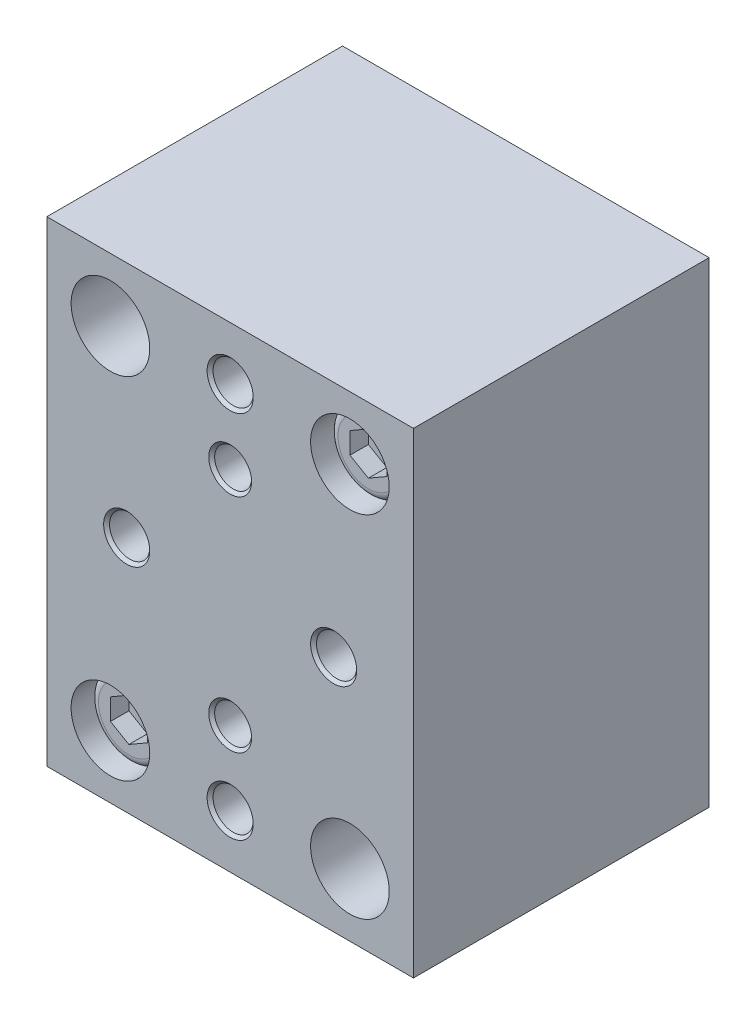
ISO-10303-21;
HEADER;
FILE_DESCRIPTION(('STEP AP214'),'2;1');
FILE_NAME('part.step','',(''),(''),'','','');
FILE_SCHEMA(('AUTOMOTIVE_DESIGN { 1 0 10303 214 1 1 1 1 }'));
ENDSEC;
DATA;
#1=APPLICATION_CONTEXT('core data for automotive mechanical design processes');
#2=APPLICATION_PROTOCOL_DEFINITION('international standard','automotive_design',2000,#1);
#3=PRODUCT_CONTEXT('',#1,'mechanical');
#4=PRODUCT('Part','Part','',(#3));
#5=PRODUCT_RELATED_PRODUCT_CATEGORY('part','',(#4));
#6=PRODUCT_DEFINITION_FORMATION('','',#4);
#7=PRODUCT_DEFINITION_CONTEXT('part definition',#1,'design');
#8=PRODUCT_DEFINITION('design','',#6,#7);
#9=PRODUCT_DEFINITION_SHAPE('','',#8);
#10=(LENGTH_UNIT() NAMED_UNIT(*) SI_UNIT(.MILLI.,.METRE.));
#11=(NAMED_UNIT(*) PLANE_ANGLE_UNIT() SI_UNIT($,.RADIAN.));
#12=(NAMED_UNIT(*) SI_UNIT($,.STERADIAN.) SOLID_ANGLE_UNIT());
#13=UNCERTAINTY_MEASURE_WITH_UNIT(LENGTH_MEASURE(1.E-05),#10,'distance_accuracy_value','');
#14=(GEOMETRIC_REPRESENTATION_CONTEXT(3) GLOBAL_UNCERTAINTY_ASSIGNED_CONTEXT((#13)) GLOBAL_UNIT_ASSIGNED_CONTEXT((#10,
#11,#12)) REPRESENTATION_CONTEXT('',''));
#15=CARTESIAN_POINT('',(0.,0.,0.));
#16=DIRECTION('',(0.,0.,1.));
#17=DIRECTION('',(1.,0.,0.));
#18=AXIS2_PLACEMENT_3D('',#15,#16,#17);
#19=CARTESIAN_POINT('',(-15.748,-20.447,23.8125));
#20=DIRECTION('',(0.,0.,1.));
#21=DIRECTION('',(1.,0.,0.));
#22=AXIS2_PLACEMENT_3D('',#19,#20,#21);
#23=PLANE('',#22);
#24=DIRECTION('',(-0.866025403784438,0.500000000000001,0.));
#25=VECTOR('',#24,1.);
#26=CARTESIAN_POINT('',(-8.6995,-14.1329564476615,23.8125));
#27=LINE('',#26,#25);
#28=CARTESIAN_POINT('',(-8.6995,-14.1329564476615,23.8125));
#29=VERTEX_POINT('',#28);
#30=CARTESIAN_POINT('',(-10.287,-13.2164128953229,23.8125));
#31=VERTEX_POINT('',#30);
#32=EDGE_CURVE('E61',#29,#31,#27,.T.);
#33=ORIENTED_EDGE('',*,*,#32,.F.);
#34=DIRECTION('',(0.,1.,0.));
#35=VECTOR('',#34,1.);
#36=CARTESIAN_POINT('',(-8.6995,-15.9660435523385,23.8125));
#37=LINE('',#36,#35);
#38=CARTESIAN_POINT('',(-8.6995,-15.9660435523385,23.8125));
#39=VERTEX_POINT('',#38);
#40=EDGE_CURVE('E144',#39,#29,#37,.T.);
#41=ORIENTED_EDGE('',*,*,#40,.F.);
#42=DIRECTION('',(0.86602540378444,0.499999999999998,0.));
#43=VECTOR('',#42,1.);
#44=CARTESIAN_POINT('',(-10.287,-16.8825871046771,23.8125));
#45=LINE('',#44,#43);
#46=CARTESIAN_POINT('',(-10.287,-16.8825871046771,23.8125));
#47=VERTEX_POINT('',#46);
#48=EDGE_CURVE('E142',#47,#39,#45,.T.);
#49=ORIENTED_EDGE('',*,*,#48,.F.);
#50=DIRECTION('',(0.86602540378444,-0.499999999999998,0.));
#51=VECTOR('',#50,1.);
#52=CARTESIAN_POINT('',(-11.8745,-15.9660435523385,23.8125));
#53=LINE('',#52,#51);
#54=CARTESIAN_POINT('',(-11.8745,-15.9660435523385,23.8125));
#55=VERTEX_POINT('',#54);
#56=EDGE_CURVE('E109',#55,#47,#53,.T.);
#57=ORIENTED_EDGE('',*,*,#56,.F.);
#58=DIRECTION('',(0.,-1.,0.));
#59=VECTOR('',#58,1.);
#60=CARTESIAN_POINT('',(-11.8745,-14.1329564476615,23.8125));
#61=LINE('',#60,#59);
#62=CARTESIAN_POINT('',(-11.8745,-14.1329564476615,23.8125));
#63=VERTEX_POINT('',#62);
#64=EDGE_CURVE('E138',#63,#55,#61,.T.);
#65=ORIENTED_EDGE('',*,*,#64,.F.);
#66=DIRECTION('',(-0.866025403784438,-0.500000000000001,0.));
#67=VECTOR('',#66,1.);
#68=CARTESIAN_POINT('',(-10.287,-13.2164128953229,23.8125));
#69=LINE('',#68,#67);
#70=EDGE_CURVE('E135',#31,#63,#69,.T.);
#71=ORIENTED_EDGE('',*,*,#70,.F.);
#72=EDGE_LOOP('',(#33,#41,#49,#57,#65,#71));
#73=FACE_BOUND('',#72,.T.);
#74=CARTESIAN_POINT('',(-10.287,-15.0495,23.8125));
#75=DIRECTION('',(0.,0.,1.));
#76=DIRECTION('',(1.,0.,0.));
#77=AXIS2_PLACEMENT_3D('',#74,#75,#76);
#78=CIRCLE('',#77,2.6162);
#79=CARTESIAN_POINT('',(-7.6708,-15.0495,23.8125));
#80=VERTEX_POINT('',#79);
#81=EDGE_CURVE('E12',#80,#80,#78,.T.);
#82=ORIENTED_EDGE('',*,*,#81,.T.);
#83=EDGE_LOOP('',(#82));
#84=FACE_BOUND('',#83,.T.);
#85=ADVANCED_FACE('F46',(#73,#84),#23,.T.);
#86=CARTESIAN_POINT('',(-10.287,-15.0495,0.));
#87=DIRECTION('',(0.,0.,-1.));
#88=DIRECTION('',(-1.,0.,0.));
#89=AXIS2_PLACEMENT_3D('',#86,#87,#88);
#90=PLANE('',#89);
#91=CARTESIAN_POINT('',(-10.287,-15.0495,0.));
#92=DIRECTION('',(0.,0.,-1.));
#93=DIRECTION('',(-1.,0.,0.));
#94=AXIS2_PLACEMENT_3D('',#91,#92,#93);
#95=CIRCLE('',#94,3.3782);
#96=CARTESIAN_POINT('',(-13.6652,-15.0495,0.));
#97=VERTEX_POINT('',#96);
#98=EDGE_CURVE('E148',#97,#97,#95,.T.);
#99=ORIENTED_EDGE('',*,*,#98,.T.);
#100=EDGE_LOOP('',(#99));
#101=FACE_BOUND('',#100,.T.);
#102=ADVANCED_FACE('F170',(#101),#90,.T.);
#103=CARTESIAN_POINT('',(-10.287,-15.0495,34.9549925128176));
#104=DIRECTION('',(0.,0.,-1.));
#105=DIRECTION('',(-1.,0.,0.));
#106=AXIS2_PLACEMENT_3D('',#103,#104,#105);
#107=CYLINDRICAL_SURFACE('',#106,3.3782);
#108=CARTESIAN_POINT('',(-10.287,-15.0495,23.0505));
#109=DIRECTION('',(0.,0.,1.));
#110=DIRECTION('',(1.,0.,0.));
#111=AXIS2_PLACEMENT_3D('',#108,#109,#110);
#112=CIRCLE('',#111,3.3782);
#113=CARTESIAN_POINT('',(-6.9088,-15.0495,23.0505));
#114=VERTEX_POINT('',#113);
#115=EDGE_CURVE('E54',#114,#114,#112,.F.);
#116=ORIENTED_EDGE('',*,*,#115,.T.);
#117=EDGE_LOOP('',(#116));
#118=FACE_BOUND('',#117,.T.);
#119=ORIENTED_EDGE('',*,*,#98,.F.);
#120=EDGE_LOOP('',(#119));
#121=FACE_BOUND('',#120,.T.);
#122=ADVANCED_FACE('F158',(#118,#121),#107,.T.);
#123=CARTESIAN_POINT('',(-10.287,-15.0495,23.0505));
#124=DIRECTION('',(0.,0.,1.));
#125=DIRECTION('',(1.,0.,0.));
#126=AXIS2_PLACEMENT_3D('',#123,#124,#125);
#127=TOROIDAL_SURFACE('',#126,2.6162,0.762);
#128=ORIENTED_EDGE('',*,*,#81,.F.);
#129=EDGE_LOOP('',(#128));
#130=FACE_BOUND('',#129,.T.);
#131=ORIENTED_EDGE('',*,*,#115,.F.);
#132=EDGE_LOOP('',(#131));
#133=FACE_BOUND('',#132,.T.);
#134=ADVANCED_FACE('F48',(#130,#133),#127,.T.);
#135=CARTESIAN_POINT('',(-8.6995,-14.1329564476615,22.225));
#136=DIRECTION('',(0.500000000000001,0.866025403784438,0.));
#137=DIRECTION('',(-0.866025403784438,0.500000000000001,0.));
#138=AXIS2_PLACEMENT_3D('',#135,#136,#137);
#139=PLANE('',#138);
#140=ORIENTED_EDGE('',*,*,#32,.T.);
#141=DIRECTION('',(0.,0.,1.));
#142=VECTOR('',#141,1.);
#143=CARTESIAN_POINT('',(-10.287,-13.2164128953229,22.225));
#144=LINE('',#143,#142);
#145=CARTESIAN_POINT('',(-10.287,-13.2164128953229,22.225));
#146=VERTEX_POINT('',#145);
#147=EDGE_CURVE('E91',#146,#31,#144,.T.);
#148=ORIENTED_EDGE('',*,*,#147,.F.);
#149=DIRECTION('',(-0.866025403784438,0.500000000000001,0.));
#150=VECTOR('',#149,1.);
#151=CARTESIAN_POINT('',(-8.6995,-14.1329564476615,22.225));
#152=LINE('',#151,#150);
#153=CARTESIAN_POINT('',(-8.6995,-14.1329564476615,22.225));
#154=VERTEX_POINT('',#153);
#155=EDGE_CURVE('E146',#154,#146,#152,.T.);
#156=ORIENTED_EDGE('',*,*,#155,.F.);
#157=DIRECTION('',(0.,0.,1.));
#158=VECTOR('',#157,1.);
#159=CARTESIAN_POINT('',(-8.6995,-14.1329564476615,22.225));
#160=LINE('',#159,#158);
#161=EDGE_CURVE('E69',#154,#29,#160,.T.);
#162=ORIENTED_EDGE('',*,*,#161,.T.);
#163=EDGE_LOOP('',(#140,#148,#156,#162));
#164=FACE_BOUND('',#163,.T.);
#165=ADVANCED_FACE('F162',(#164),#139,.F.);
#166=CARTESIAN_POINT('',(-8.6995,-15.9660435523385,22.225));
#167=DIRECTION('',(1.,0.,0.));
#168=DIRECTION('',(0.,0.,-1.));
#169=AXIS2_PLACEMENT_3D('',#166,#167,#168);
#170=PLANE('',#169);
#171=ORIENTED_EDGE('',*,*,#40,.T.);
#172=ORIENTED_EDGE('',*,*,#161,.F.);
#173=DIRECTION('',(0.,1.,0.));
#174=VECTOR('',#173,1.);
#175=CARTESIAN_POINT('',(-8.6995,-15.9660435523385,22.225));
#176=LINE('',#175,#174);
#177=CARTESIAN_POINT('',(-8.6995,-15.9660435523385,22.225));
#178=VERTEX_POINT('',#177);
#179=EDGE_CURVE('E121',#178,#154,#176,.T.);
#180=ORIENTED_EDGE('',*,*,#179,.F.);
#181=DIRECTION('',(0.,0.,1.));
#182=VECTOR('',#181,1.);
#183=CARTESIAN_POINT('',(-8.6995,-15.9660435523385,22.225));
#184=LINE('',#183,#182);
#185=EDGE_CURVE('E113',#178,#39,#184,.T.);
#186=ORIENTED_EDGE('',*,*,#185,.T.);
#187=EDGE_LOOP('',(#171,#172,#180,#186));
#188=FACE_BOUND('',#187,.T.);
#189=ADVANCED_FACE('F168',(#188),#170,.F.);
#190=CARTESIAN_POINT('',(-10.287,-16.8825871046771,22.225));
#191=DIRECTION('',(0.499999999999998,-0.86602540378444,0.));
#192=DIRECTION('',(0.86602540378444,0.499999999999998,0.));
#193=AXIS2_PLACEMENT_3D('',#190,#191,#192);
#194=PLANE('',#193);
#195=ORIENTED_EDGE('',*,*,#48,.T.);
#196=ORIENTED_EDGE('',*,*,#185,.F.);
#197=DIRECTION('',(0.86602540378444,0.499999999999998,0.));
#198=VECTOR('',#197,1.);
#199=CARTESIAN_POINT('',(-10.287,-16.8825871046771,22.225));
#200=LINE('',#199,#198);
#201=CARTESIAN_POINT('',(-10.287,-16.8825871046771,22.225));
#202=VERTEX_POINT('',#201);
#203=EDGE_CURVE('E117',#202,#178,#200,.T.);
#204=ORIENTED_EDGE('',*,*,#203,.F.);
#205=DIRECTION('',(0.,0.,1.));
#206=VECTOR('',#205,1.);
#207=CARTESIAN_POINT('',(-10.287,-16.8825871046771,22.225));
#208=LINE('',#207,#206);
#209=EDGE_CURVE('E102',#202,#47,#208,.T.);
#210=ORIENTED_EDGE('',*,*,#209,.T.);
#211=EDGE_LOOP('',(#195,#196,#204,#210));
#212=FACE_BOUND('',#211,.T.);
#213=ADVANCED_FACE('F118',(#212),#194,.F.);
#214=CARTESIAN_POINT('',(-11.8745,-15.9660435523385,22.225));
#215=DIRECTION('',(-0.499999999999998,-0.86602540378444,0.));
#216=DIRECTION('',(0.86602540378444,-0.499999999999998,0.));
#217=AXIS2_PLACEMENT_3D('',#214,#215,#216);
#218=PLANE('',#217);
#219=ORIENTED_EDGE('',*,*,#56,.T.);
#220=ORIENTED_EDGE('',*,*,#209,.F.);
#221=DIRECTION('',(0.86602540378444,-0.499999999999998,0.));
#222=VECTOR('',#221,1.);
#223=CARTESIAN_POINT('',(-11.8745,-15.9660435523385,22.225));
#224=LINE('',#223,#222);
#225=CARTESIAN_POINT('',(-11.8745,-15.9660435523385,22.225));
#226=VERTEX_POINT('',#225);
#227=EDGE_CURVE('E106',#226,#202,#224,.T.);
#228=ORIENTED_EDGE('',*,*,#227,.F.);
#229=DIRECTION('',(0.,0.,1.));
#230=VECTOR('',#229,1.);
#231=CARTESIAN_POINT('',(-11.8745,-15.9660435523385,22.225));
#232=LINE('',#231,#230);
#233=EDGE_CURVE('E114',#226,#55,#232,.T.);
#234=ORIENTED_EDGE('',*,*,#233,.T.);
#235=EDGE_LOOP('',(#219,#220,#228,#234));
#236=FACE_BOUND('',#235,.T.);
#237=ADVANCED_FACE('F104',(#236),#218,.F.);
#238=CARTESIAN_POINT('',(-11.8745,-14.1329564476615,22.225));
#239=DIRECTION('',(-1.,0.,0.));
#240=DIRECTION('',(0.,-1.,0.));
#241=AXIS2_PLACEMENT_3D('',#238,#239,#240);
#242=PLANE('',#241);
#243=ORIENTED_EDGE('',*,*,#64,.T.);
#244=ORIENTED_EDGE('',*,*,#233,.F.);
#245=DIRECTION('',(0.,-1.,0.));
#246=VECTOR('',#245,1.);
#247=CARTESIAN_POINT('',(-11.8745,-14.1329564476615,22.225));
#248=LINE('',#247,#246);
#249=CARTESIAN_POINT('',(-11.8745,-14.1329564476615,22.225));
#250=VERTEX_POINT('',#249);
#251=EDGE_CURVE('E127',#250,#226,#248,.T.);
#252=ORIENTED_EDGE('',*,*,#251,.F.);
#253=DIRECTION('',(0.,0.,1.));
#254=VECTOR('',#253,1.);
#255=CARTESIAN_POINT('',(-11.8745,-14.1329564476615,22.225));
#256=LINE('',#255,#254);
#257=EDGE_CURVE('E151',#250,#63,#256,.T.);
#258=ORIENTED_EDGE('',*,*,#257,.T.);
#259=EDGE_LOOP('',(#243,#244,#252,#258));
#260=FACE_BOUND('',#259,.T.);
#261=ADVANCED_FACE('F185',(#260),#242,.F.);
#262=CARTESIAN_POINT('',(-10.287,-13.2164128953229,22.225));
#263=DIRECTION('',(-0.500000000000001,0.866025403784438,0.));
#264=DIRECTION('',(-0.866025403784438,-0.500000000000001,0.));
#265=AXIS2_PLACEMENT_3D('',#262,#263,#264);
#266=PLANE('',#265);
#267=ORIENTED_EDGE('',*,*,#70,.T.);
#268=ORIENTED_EDGE('',*,*,#257,.F.);
#269=DIRECTION('',(-0.866025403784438,-0.500000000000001,0.));
#270=VECTOR('',#269,1.);
#271=CARTESIAN_POINT('',(-10.287,-13.2164128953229,22.225));
#272=LINE('',#271,#270);
#273=EDGE_CURVE('E129',#146,#250,#272,.T.);
#274=ORIENTED_EDGE('',*,*,#273,.F.);
#275=ORIENTED_EDGE('',*,*,#147,.T.);
#276=EDGE_LOOP('',(#267,#268,#274,#275));
#277=FACE_BOUND('',#276,.T.);
#278=ADVANCED_FACE('F182',(#277),#266,.F.);
#279=CARTESIAN_POINT('',(0.,0.,22.225));
#280=DIRECTION('',(0.,0.,1.));
#281=DIRECTION('',(1.,0.,0.));
#282=AXIS2_PLACEMENT_3D('',#279,#280,#281);
#283=PLANE('',#282);
#284=ORIENTED_EDGE('',*,*,#155,.T.);
#285=ORIENTED_EDGE('',*,*,#273,.T.);
#286=ORIENTED_EDGE('',*,*,#251,.T.);
#287=ORIENTED_EDGE('',*,*,#227,.T.);
#288=ORIENTED_EDGE('',*,*,#203,.T.);
#289=ORIENTED_EDGE('',*,*,#179,.T.);
#290=EDGE_LOOP('',(#284,#285,#286,#287,#288,#289));
#291=FACE_BOUND('',#290,.T.);
#292=ADVANCED_FACE('F124',(#291),#283,.T.);
#293=CLOSED_SHELL('',(#85,#102,#122,#134,#165,#189,#213,#237,#261,#278,#292));
#294=MANIFOLD_SOLID_BREP('B2',#293);
#295=CARTESIAN_POINT('',(-15.748,-20.447,23.8125));
#296=DIRECTION('',(0.,0.,1.));
#297=DIRECTION('',(1.,0.,0.));
#298=AXIS2_PLACEMENT_3D('',#295,#296,#297);
#299=PLANE('',#298);
#300=DIRECTION('',(-0.866025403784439,0.5,0.));
#301=VECTOR('',#300,1.);
#302=CARTESIAN_POINT('',(11.8745,15.9660435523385,23.8125));
#303=LINE('',#302,#301);
#304=CARTESIAN_POINT('',(11.8745,15.9660435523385,23.8125));
#305=VERTEX_POINT('',#304);
#306=CARTESIAN_POINT('',(10.287,16.8825871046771,23.8125));
#307=VERTEX_POINT('',#306);
#308=EDGE_CURVE('E292',#305,#307,#303,.T.);
#309=ORIENTED_EDGE('',*,*,#308,.F.);
#310=DIRECTION('',(0.,1.,0.));
#311=VECTOR('',#310,1.);
#312=CARTESIAN_POINT('',(11.8745,14.1329564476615,23.8125));
#313=LINE('',#312,#311);
#314=CARTESIAN_POINT('',(11.8745,14.1329564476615,23.8125));
#315=VERTEX_POINT('',#314);
#316=EDGE_CURVE('E375',#315,#305,#313,.T.);
#317=ORIENTED_EDGE('',*,*,#316,.F.);
#318=DIRECTION('',(0.866025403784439,0.5,0.));
#319=VECTOR('',#318,1.);
#320=CARTESIAN_POINT('',(10.287,13.2164128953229,23.8125));
#321=LINE('',#320,#319);
#322=CARTESIAN_POINT('',(10.287,13.2164128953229,23.8125));
#323=VERTEX_POINT('',#322);
#324=EDGE_CURVE('E373',#323,#315,#321,.T.);
#325=ORIENTED_EDGE('',*,*,#324,.F.);
#326=DIRECTION('',(0.866025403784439,-0.5,0.));
#327=VECTOR('',#326,1.);
#328=CARTESIAN_POINT('',(8.6995,14.1329564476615,23.8125));
#329=LINE('',#328,#327);
#330=CARTESIAN_POINT('',(8.6995,14.1329564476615,23.8125));
#331=VERTEX_POINT('',#330);
#332=EDGE_CURVE('E340',#331,#323,#329,.T.);
#333=ORIENTED_EDGE('',*,*,#332,.F.);
#334=DIRECTION('',(0.,-1.,0.));
#335=VECTOR('',#334,1.);
#336=CARTESIAN_POINT('',(8.6995,15.9660435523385,23.8125));
#337=LINE('',#336,#335);
#338=CARTESIAN_POINT('',(8.6995,15.9660435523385,23.8125));
#339=VERTEX_POINT('',#338);
#340=EDGE_CURVE('E369',#339,#331,#337,.T.);
#341=ORIENTED_EDGE('',*,*,#340,.F.);
#342=DIRECTION('',(-0.866025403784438,-0.5,0.));
#343=VECTOR('',#342,1.);
#344=CARTESIAN_POINT('',(10.287,16.8825871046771,23.8125));
#345=LINE('',#344,#343);
#346=EDGE_CURVE('E366',#307,#339,#345,.T.);
#347=ORIENTED_EDGE('',*,*,#346,.F.);
#348=EDGE_LOOP('',(#309,#317,#325,#333,#341,#347));
#349=FACE_BOUND('',#348,.T.);
#350=CARTESIAN_POINT('',(10.287,15.0495,23.8125));
#351=DIRECTION('',(0.,0.,1.));
#352=DIRECTION('',(1.,0.,0.));
#353=AXIS2_PLACEMENT_3D('',#350,#351,#352);
#354=CIRCLE('',#353,2.6162);
#355=CARTESIAN_POINT('',(12.9032,15.0495,23.8125));
#356=VERTEX_POINT('',#355);
#357=EDGE_CURVE('E44',#356,#356,#354,.T.);
#358=ORIENTED_EDGE('',*,*,#357,.T.);
#359=EDGE_LOOP('',(#358));
#360=FACE_BOUND('',#359,.T.);
#361=ADVANCED_FACE('F277',(#349,#360),#299,.T.);
#362=CARTESIAN_POINT('',(10.287,15.0495,0.));
#363=DIRECTION('',(0.,0.,-1.));
#364=DIRECTION('',(-1.,0.,0.));
#365=AXIS2_PLACEMENT_3D('',#362,#363,#364);
#366=PLANE('',#365);
#367=CARTESIAN_POINT('',(10.287,15.0495,0.));
#368=DIRECTION('',(0.,0.,-1.));
#369=DIRECTION('',(-1.,0.,0.));
#370=AXIS2_PLACEMENT_3D('',#367,#368,#369);
#371=CIRCLE('',#370,3.3782);
#372=CARTESIAN_POINT('',(6.9088,15.0495,0.));
#373=VERTEX_POINT('',#372);
#374=EDGE_CURVE('E379',#373,#373,#371,.T.);
#375=ORIENTED_EDGE('',*,*,#374,.T.);
#376=EDGE_LOOP('',(#375));
#377=FACE_BOUND('',#376,.T.);
#378=ADVANCED_FACE('F401',(#377),#366,.T.);
#379=CARTESIAN_POINT('',(10.287,15.0495,34.9549925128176));
#380=DIRECTION('',(0.,0.,-1.));
#381=DIRECTION('',(-1.,0.,0.));
#382=AXIS2_PLACEMENT_3D('',#379,#380,#381);
#383=CYLINDRICAL_SURFACE('',#382,3.3782);
#384=CARTESIAN_POINT('',(10.287,15.0495,23.0505));
#385=DIRECTION('',(0.,0.,1.));
#386=DIRECTION('',(1.,0.,0.));
#387=AXIS2_PLACEMENT_3D('',#384,#385,#386);
#388=CIRCLE('',#387,3.3782);
#389=CARTESIAN_POINT('',(13.6652,15.0495,23.0505));
#390=VERTEX_POINT('',#389);
#391=EDGE_CURVE('E285',#390,#390,#388,.F.);
#392=ORIENTED_EDGE('',*,*,#391,.T.);
#393=EDGE_LOOP('',(#392));
#394=FACE_BOUND('',#393,.T.);
#395=ORIENTED_EDGE('',*,*,#374,.F.);
#396=EDGE_LOOP('',(#395));
#397=FACE_BOUND('',#396,.T.);
#398=ADVANCED_FACE('F389',(#394,#397),#383,.T.);
#399=CARTESIAN_POINT('',(10.287,15.0495,23.0505));
#400=DIRECTION('',(0.,0.,1.));
#401=DIRECTION('',(1.,0.,0.));
#402=AXIS2_PLACEMENT_3D('',#399,#400,#401);
#403=TOROIDAL_SURFACE('',#402,2.6162,0.762);
#404=ORIENTED_EDGE('',*,*,#357,.F.);
#405=EDGE_LOOP('',(#404));
#406=FACE_BOUND('',#405,.T.);
#407=ORIENTED_EDGE('',*,*,#391,.F.);
#408=EDGE_LOOP('',(#407));
#409=FACE_BOUND('',#408,.T.);
#410=ADVANCED_FACE('F279',(#406,#409),#403,.T.);
#411=CARTESIAN_POINT('',(11.8745,15.9660435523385,22.225));
#412=DIRECTION('',(0.5,0.866025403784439,0.));
#413=DIRECTION('',(-0.866025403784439,0.5,0.));
#414=AXIS2_PLACEMENT_3D('',#411,#412,#413);
#415=PLANE('',#414);
#416=ORIENTED_EDGE('',*,*,#308,.T.);
#417=DIRECTION('',(0.,0.,1.));
#418=VECTOR('',#417,1.);
#419=CARTESIAN_POINT('',(10.287,16.8825871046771,22.225));
#420=LINE('',#419,#418);
#421=CARTESIAN_POINT('',(10.287,16.8825871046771,22.225));
#422=VERTEX_POINT('',#421);
#423=EDGE_CURVE('E322',#422,#307,#420,.T.);
#424=ORIENTED_EDGE('',*,*,#423,.F.);
#425=DIRECTION('',(-0.866025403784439,0.5,0.));
#426=VECTOR('',#425,1.);
#427=CARTESIAN_POINT('',(11.8745,15.9660435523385,22.225));
#428=LINE('',#427,#426);
#429=CARTESIAN_POINT('',(11.8745,15.9660435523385,22.225));
#430=VERTEX_POINT('',#429);
#431=EDGE_CURVE('E377',#430,#422,#428,.T.);
#432=ORIENTED_EDGE('',*,*,#431,.F.);
#433=DIRECTION('',(0.,0.,1.));
#434=VECTOR('',#433,1.);
#435=CARTESIAN_POINT('',(11.8745,15.9660435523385,22.225));
#436=LINE('',#435,#434);
#437=EDGE_CURVE('E300',#430,#305,#436,.T.);
#438=ORIENTED_EDGE('',*,*,#437,.T.);
#439=EDGE_LOOP('',(#416,#424,#432,#438));
#440=FACE_BOUND('',#439,.T.);
#441=ADVANCED_FACE('F393',(#440),#415,.F.);
#442=CARTESIAN_POINT('',(11.8745,14.1329564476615,22.225));
#443=DIRECTION('',(1.,0.,0.));
#444=DIRECTION('',(0.,1.,0.));
#445=AXIS2_PLACEMENT_3D('',#442,#443,#444);
#446=PLANE('',#445);
#447=ORIENTED_EDGE('',*,*,#316,.T.);
#448=ORIENTED_EDGE('',*,*,#437,.F.);
#449=DIRECTION('',(0.,1.,0.));
#450=VECTOR('',#449,1.);
#451=CARTESIAN_POINT('',(11.8745,14.1329564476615,22.225));
#452=LINE('',#451,#450);
#453=CARTESIAN_POINT('',(11.8745,14.1329564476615,22.225));
#454=VERTEX_POINT('',#453);
#455=EDGE_CURVE('E352',#454,#430,#452,.T.);
#456=ORIENTED_EDGE('',*,*,#455,.F.);
#457=DIRECTION('',(0.,0.,1.));
#458=VECTOR('',#457,1.);
#459=CARTESIAN_POINT('',(11.8745,14.1329564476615,22.225));
#460=LINE('',#459,#458);
#461=EDGE_CURVE('E344',#454,#315,#460,.T.);
#462=ORIENTED_EDGE('',*,*,#461,.T.);
#463=EDGE_LOOP('',(#447,#448,#456,#462));
#464=FACE_BOUND('',#463,.T.);
#465=ADVANCED_FACE('F399',(#464),#446,.F.);
#466=CARTESIAN_POINT('',(10.287,13.2164128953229,22.225));
#467=DIRECTION('',(0.5,-0.866025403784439,0.));
#468=DIRECTION('',(0.866025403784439,0.5,0.));
#469=AXIS2_PLACEMENT_3D('',#466,#467,#468);
#470=PLANE('',#469);
#471=ORIENTED_EDGE('',*,*,#324,.T.);
#472=ORIENTED_EDGE('',*,*,#461,.F.);
#473=DIRECTION('',(0.866025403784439,0.5,0.));
#474=VECTOR('',#473,1.);
#475=CARTESIAN_POINT('',(10.287,13.2164128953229,22.225));
#476=LINE('',#475,#474);
#477=CARTESIAN_POINT('',(10.287,13.2164128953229,22.225));
#478=VERTEX_POINT('',#477);
#479=EDGE_CURVE('E348',#478,#454,#476,.T.);
#480=ORIENTED_EDGE('',*,*,#479,.F.);
#481=DIRECTION('',(0.,0.,1.));
#482=VECTOR('',#481,1.);
#483=CARTESIAN_POINT('',(10.287,13.2164128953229,22.225));
#484=LINE('',#483,#482);
#485=EDGE_CURVE('E333',#478,#323,#484,.T.);
#486=ORIENTED_EDGE('',*,*,#485,.T.);
#487=EDGE_LOOP('',(#471,#472,#480,#486));
#488=FACE_BOUND('',#487,.T.);
#489=ADVANCED_FACE('F349',(#488),#470,.F.);
#490=CARTESIAN_POINT('',(8.6995,14.1329564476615,22.225));
#491=DIRECTION('',(-0.5,-0.866025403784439,0.));
#492=DIRECTION('',(0.866025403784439,-0.5,0.));
#493=AXIS2_PLACEMENT_3D('',#490,#491,#492);
#494=PLANE('',#493);
#495=ORIENTED_EDGE('',*,*,#332,.T.);
#496=ORIENTED_EDGE('',*,*,#485,.F.);
#497=DIRECTION('',(0.866025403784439,-0.5,0.));
#498=VECTOR('',#497,1.);
#499=CARTESIAN_POINT('',(8.6995,14.1329564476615,22.225));
#500=LINE('',#499,#498);
#501=CARTESIAN_POINT('',(8.6995,14.1329564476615,22.225));
#502=VERTEX_POINT('',#501);
#503=EDGE_CURVE('E337',#502,#478,#500,.T.);
#504=ORIENTED_EDGE('',*,*,#503,.F.);
#505=DIRECTION('',(0.,0.,1.));
#506=VECTOR('',#505,1.);
#507=CARTESIAN_POINT('',(8.6995,14.1329564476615,22.225));
#508=LINE('',#507,#506);
#509=EDGE_CURVE('E345',#502,#331,#508,.T.);
#510=ORIENTED_EDGE('',*,*,#509,.T.);
#511=EDGE_LOOP('',(#495,#496,#504,#510));
#512=FACE_BOUND('',#511,.T.);
#513=ADVANCED_FACE('F335',(#512),#494,.F.);
#514=CARTESIAN_POINT('',(8.6995,15.9660435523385,22.225));
#515=DIRECTION('',(-1.,0.,0.));
#516=DIRECTION('',(0.,0.,1.));
#517=AXIS2_PLACEMENT_3D('',#514,#515,#516);
#518=PLANE('',#517);
#519=ORIENTED_EDGE('',*,*,#340,.T.);
#520=ORIENTED_EDGE('',*,*,#509,.F.);
#521=DIRECTION('',(0.,-1.,0.));
#522=VECTOR('',#521,1.);
#523=CARTESIAN_POINT('',(8.6995,15.9660435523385,22.225));
#524=LINE('',#523,#522);
#525=CARTESIAN_POINT('',(8.6995,15.9660435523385,22.225));
#526=VERTEX_POINT('',#525);
#527=EDGE_CURVE('E358',#526,#502,#524,.T.);
#528=ORIENTED_EDGE('',*,*,#527,.F.);
#529=DIRECTION('',(0.,0.,1.));
#530=VECTOR('',#529,1.);
#531=CARTESIAN_POINT('',(8.6995,15.9660435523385,22.225));
#532=LINE('',#531,#530);
#533=EDGE_CURVE('E382',#526,#339,#532,.T.);
#534=ORIENTED_EDGE('',*,*,#533,.T.);
#535=EDGE_LOOP('',(#519,#520,#528,#534));
#536=FACE_BOUND('',#535,.T.);
#537=ADVANCED_FACE('F416',(#536),#518,.F.);
#538=CARTESIAN_POINT('',(10.287,16.8825871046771,22.225));
#539=DIRECTION('',(-0.5,0.866025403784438,0.));
#540=DIRECTION('',(-0.866025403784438,-0.5,0.));
#541=AXIS2_PLACEMENT_3D('',#538,#539,#540);
#542=PLANE('',#541);
#543=ORIENTED_EDGE('',*,*,#346,.T.);
#544=ORIENTED_EDGE('',*,*,#533,.F.);
#545=DIRECTION('',(-0.866025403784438,-0.5,0.));
#546=VECTOR('',#545,1.);
#547=CARTESIAN_POINT('',(10.287,16.8825871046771,22.225));
#548=LINE('',#547,#546);
#549=EDGE_CURVE('E360',#422,#526,#548,.T.);
#550=ORIENTED_EDGE('',*,*,#549,.F.);
#551=ORIENTED_EDGE('',*,*,#423,.T.);
#552=EDGE_LOOP('',(#543,#544,#550,#551));
#553=FACE_BOUND('',#552,.T.);
#554=ADVANCED_FACE('F413',(#553),#542,.F.);
#555=CARTESIAN_POINT('',(0.,0.,22.225));
#556=DIRECTION('',(0.,0.,1.));
#557=DIRECTION('',(1.,0.,0.));
#558=AXIS2_PLACEMENT_3D('',#555,#556,#557);
#559=PLANE('',#558);
#560=ORIENTED_EDGE('',*,*,#431,.T.);
#561=ORIENTED_EDGE('',*,*,#549,.T.);
#562=ORIENTED_EDGE('',*,*,#527,.T.);
#563=ORIENTED_EDGE('',*,*,#503,.T.);
#564=ORIENTED_EDGE('',*,*,#479,.T.);
#565=ORIENTED_EDGE('',*,*,#455,.T.);
#566=EDGE_LOOP('',(#560,#561,#562,#563,#564,#565));
#567=FACE_BOUND('',#566,.T.);
#568=ADVANCED_FACE('F355',(#567),#559,.T.);
#569=CLOSED_SHELL('',(#361,#378,#398,#410,#441,#465,#489,#513,#537,#554,#568));
#570=MANIFOLD_SOLID_BREP('B6',#569);
#571=CARTESIAN_POINT('',(-15.748,-20.447,0.));
#572=DIRECTION('',(0.,0.,1.));
#573=DIRECTION('',(1.,0.,0.));
#574=AXIS2_PLACEMENT_3D('',#571,#572,#573);
#575=PLANE('',#574);
#576=CARTESIAN_POINT('',(-8.89,0.,0.));
#577=DIRECTION('',(0.,0.,1.));
#578=DIRECTION('',(1.,0.,0.));
#579=AXIS2_PLACEMENT_3D('',#576,#577,#578);
#580=CIRCLE('',#579,1.72719999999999);
#581=CARTESIAN_POINT('',(-7.1628,0.,0.));
#582=VERTEX_POINT('',#581);
#583=EDGE_CURVE('E797',#582,#582,#580,.T.);
#584=ORIENTED_EDGE('',*,*,#583,.T.);
#585=EDGE_LOOP('',(#584));
#586=FACE_BOUND('',#585,.T.);
#587=CARTESIAN_POINT('',(8.89,0.,0.));
#588=DIRECTION('',(0.,0.,1.));
#589=DIRECTION('',(1.,0.,0.));
#590=AXIS2_PLACEMENT_3D('',#587,#588,#589);
#591=CIRCLE('',#590,1.72719999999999);
#592=CARTESIAN_POINT('',(10.6172,0.,0.));
#593=VERTEX_POINT('',#592);
#594=EDGE_CURVE('E679',#593,#593,#591,.T.);
#595=ORIENTED_EDGE('',*,*,#594,.T.);
#596=EDGE_LOOP('',(#595));
#597=FACE_BOUND('',#596,.T.);
#598=CARTESIAN_POINT('',(0.,15.875,0.));
#599=DIRECTION('',(0.,0.,1.));
#600=DIRECTION('',(1.,0.,0.));
#601=AXIS2_PLACEMENT_3D('',#598,#599,#600);
#602=CIRCLE('',#601,1.72719999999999);
#603=CARTESIAN_POINT('',(1.72719999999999,15.875,0.));
#604=VERTEX_POINT('',#603);
#605=EDGE_CURVE('E673',#604,#604,#602,.T.);
#606=ORIENTED_EDGE('',*,*,#605,.T.);
#607=EDGE_LOOP('',(#606));
#608=FACE_BOUND('',#607,.T.);
#609=CARTESIAN_POINT('',(0.,-15.875,0.));
#610=DIRECTION('',(0.,0.,1.));
#611=DIRECTION('',(1.,0.,0.));
#612=AXIS2_PLACEMENT_3D('',#609,#610,#611);
#613=CIRCLE('',#612,1.72719999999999);
#614=CARTESIAN_POINT('',(1.72719999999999,-15.875,0.));
#615=VERTEX_POINT('',#614);
#616=EDGE_CURVE('E670',#615,#615,#613,.T.);
#617=ORIENTED_EDGE('',*,*,#616,.T.);
#618=EDGE_LOOP('',(#617));
#619=FACE_BOUND('',#618,.T.);
#620=CARTESIAN_POINT('',(0.,9.525,0.));
#621=DIRECTION('',(0.,0.,-1.));
#622=DIRECTION('',(-1.,0.,0.));
#623=AXIS2_PLACEMENT_3D('',#620,#621,#622);
#624=CIRCLE('',#623,2.98450000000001);
#625=CARTESIAN_POINT('',(-2.98450000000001,9.525,0.));
#626=VERTEX_POINT('',#625);
#627=EDGE_CURVE('E672',#626,#626,#624,.T.);
#628=ORIENTED_EDGE('',*,*,#627,.F.);
#629=EDGE_LOOP('',(#628));
#630=FACE_BOUND('',#629,.T.);
#631=CARTESIAN_POINT('',(10.287,-15.0495,0.));
#632=DIRECTION('',(0.,0.,1.));
#633=DIRECTION('',(1.,0.,0.));
#634=AXIS2_PLACEMENT_3D('',#631,#632,#633);
#635=CIRCLE('',#634,3.3782);
#636=CARTESIAN_POINT('',(13.6652,-15.0495,0.));
#637=VERTEX_POINT('',#636);
#638=EDGE_CURVE('E698',#637,#637,#635,.T.);
#639=ORIENTED_EDGE('',*,*,#638,.T.);
#640=EDGE_LOOP('',(#639));
#641=FACE_BOUND('',#640,.T.);
#642=CARTESIAN_POINT('',(-10.287,-15.0495,0.));
#643=DIRECTION('',(0.,0.,1.));
#644=DIRECTION('',(1.,0.,0.));
#645=AXIS2_PLACEMENT_3D('',#642,#643,#644);
#646=CIRCLE('',#645,3.3782);
#647=CARTESIAN_POINT('',(-6.9088,-15.0495,0.));
#648=VERTEX_POINT('',#647);
#649=EDGE_CURVE('E704',#648,#648,#646,.T.);
#650=ORIENTED_EDGE('',*,*,#649,.T.);
#651=EDGE_LOOP('',(#650));
#652=FACE_BOUND('',#651,.T.);
#653=CARTESIAN_POINT('',(10.287,15.0495,0.));
#654=DIRECTION('',(0.,0.,1.));
#655=DIRECTION('',(1.,0.,0.));
#656=AXIS2_PLACEMENT_3D('',#653,#654,#655);
#657=CIRCLE('',#656,3.3782);
#658=CARTESIAN_POINT('',(13.6652,15.0495,0.));
#659=VERTEX_POINT('',#658);
#660=EDGE_CURVE('E710',#659,#659,#657,.T.);
#661=ORIENTED_EDGE('',*,*,#660,.T.);
#662=EDGE_LOOP('',(#661));
#663=FACE_BOUND('',#662,.T.);
#664=CARTESIAN_POINT('',(-10.287,15.0495,0.));
#665=DIRECTION('',(0.,0.,1.));
#666=DIRECTION('',(1.,0.,0.));
#667=AXIS2_PLACEMENT_3D('',#664,#665,#666);
#668=CIRCLE('',#667,3.3782);
#669=CARTESIAN_POINT('',(-6.9088,15.0495,0.));
#670=VERTEX_POINT('',#669);
#671=EDGE_CURVE('E570',#670,#670,#668,.T.);
#672=ORIENTED_EDGE('',*,*,#671,.T.);
#673=EDGE_LOOP('',(#672));
#674=FACE_BOUND('',#673,.T.);
#675=DIRECTION('',(0.,-1.,0.));
#676=VECTOR('',#675,1.);
#677=CARTESIAN_POINT('',(-15.748,20.447,0.));
#678=LINE('',#677,#676);
#679=CARTESIAN_POINT('',(-15.748,20.447,0.));
#680=VERTEX_POINT('',#679);
#681=CARTESIAN_POINT('',(-15.748,-20.447,0.));
#682=VERTEX_POINT('',#681);
#683=EDGE_CURVE('E567',#680,#682,#678,.T.);
#684=ORIENTED_EDGE('',*,*,#683,.F.);
#685=DIRECTION('',(-1.,0.,0.));
#686=VECTOR('',#685,1.);
#687=CARTESIAN_POINT('',(-15.748,20.447,0.));
#688=LINE('',#687,#686);
#689=CARTESIAN_POINT('',(15.748,20.447,0.));
#690=VERTEX_POINT('',#689);
#691=EDGE_CURVE('E539',#690,#680,#688,.T.);
#692=ORIENTED_EDGE('',*,*,#691,.F.);
#693=DIRECTION('',(0.,1.,0.));
#694=VECTOR('',#693,1.);
#695=CARTESIAN_POINT('',(15.748,20.447,0.));
#696=LINE('',#695,#694);
#697=CARTESIAN_POINT('',(15.748,-20.447,0.));
#698=VERTEX_POINT('',#697);
#699=EDGE_CURVE('E533',#698,#690,#696,.T.);
#700=ORIENTED_EDGE('',*,*,#699,.F.);
#701=DIRECTION('',(1.,0.,0.));
#702=VECTOR('',#701,1.);
#703=CARTESIAN_POINT('',(-15.748,-20.447,0.));
#704=LINE('',#703,#702);
#705=EDGE_CURVE('E557',#682,#698,#704,.T.);
#706=ORIENTED_EDGE('',*,*,#705,.F.);
#707=EDGE_LOOP('',(#684,#692,#700,#706));
#708=FACE_BOUND('',#707,.T.);
#709=CARTESIAN_POINT('',(0.,-9.525,0.));
#710=DIRECTION('',(0.,0.,-1.));
#711=DIRECTION('',(-1.,0.,0.));
#712=AXIS2_PLACEMENT_3D('',#709,#710,#711);
#713=CIRCLE('',#712,2.98450000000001);
#714=CARTESIAN_POINT('',(-2.98450000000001,-9.525,0.));
#715=VERTEX_POINT('',#714);
#716=EDGE_CURVE('E688',#715,#715,#713,.T.);
#717=ORIENTED_EDGE('',*,*,#716,.F.);
#718=EDGE_LOOP('',(#717));
#719=FACE_BOUND('',#718,.T.);
#720=ADVANCED_FACE('F499',(#586,#597,#608,#619,#630,#641,#652,#663,#674,#708,#719),#575,.F.);
#721=CARTESIAN_POINT('',(-15.748,20.447,25.4));
#722=DIRECTION('',(1.,0.,0.));
#723=DIRECTION('',(0.,1.,0.));
#724=AXIS2_PLACEMENT_3D('',#721,#722,#723);
#725=PLANE('',#724);
#726=ORIENTED_EDGE('',*,*,#683,.T.);
#727=DIRECTION('',(0.,0.,-1.));
#728=VECTOR('',#727,1.);
#729=CARTESIAN_POINT('',(-15.748,-20.447,25.4));
#730=LINE('',#729,#728);
#731=CARTESIAN_POINT('',(-15.748,-20.447,25.4));
#732=VERTEX_POINT('',#731);
#733=EDGE_CURVE('E558',#732,#682,#730,.T.);
#734=ORIENTED_EDGE('',*,*,#733,.F.);
#735=DIRECTION('',(0.,-1.,0.));
#736=VECTOR('',#735,1.);
#737=CARTESIAN_POINT('',(-15.748,20.447,25.4));
#738=LINE('',#737,#736);
#739=CARTESIAN_POINT('',(-15.748,20.447,25.4));
#740=VERTEX_POINT('',#739);
#741=EDGE_CURVE('E552',#740,#732,#738,.T.);
#742=ORIENTED_EDGE('',*,*,#741,.F.);
#743=DIRECTION('',(0.,0.,-1.));
#744=VECTOR('',#743,1.);
#745=CARTESIAN_POINT('',(-15.748,20.447,25.4));
#746=LINE('',#745,#744);
#747=EDGE_CURVE('E563',#740,#680,#746,.T.);
#748=ORIENTED_EDGE('',*,*,#747,.T.);
#749=EDGE_LOOP('',(#726,#734,#742,#748));
#750=FACE_BOUND('',#749,.T.);
#751=ADVANCED_FACE('F626',(#750),#725,.F.);
#752=CARTESIAN_POINT('',(-15.748,-20.447,25.4));
#753=DIRECTION('',(0.,1.,0.));
#754=DIRECTION('',(0.,0.,1.));
#755=AXIS2_PLACEMENT_3D('',#752,#753,#754);
#756=PLANE('',#755);
#757=ORIENTED_EDGE('',*,*,#705,.T.);
#758=DIRECTION('',(0.,0.,-1.));
#759=VECTOR('',#758,1.);
#760=CARTESIAN_POINT('',(15.748,-20.447,25.4));
#761=LINE('',#760,#759);
#762=CARTESIAN_POINT('',(15.748,-20.447,25.4));
#763=VERTEX_POINT('',#762);
#764=EDGE_CURVE('E555',#763,#698,#761,.T.);
#765=ORIENTED_EDGE('',*,*,#764,.F.);
#766=DIRECTION('',(1.,0.,0.));
#767=VECTOR('',#766,1.);
#768=CARTESIAN_POINT('',(-15.748,-20.447,25.4));
#769=LINE('',#768,#767);
#770=EDGE_CURVE('E547',#732,#763,#769,.T.);
#771=ORIENTED_EDGE('',*,*,#770,.F.);
#772=ORIENTED_EDGE('',*,*,#733,.T.);
#773=EDGE_LOOP('',(#757,#765,#771,#772));
#774=FACE_BOUND('',#773,.T.);
#775=ADVANCED_FACE('F556',(#774),#756,.F.);
#776=CARTESIAN_POINT('',(15.748,20.447,25.4));
#777=DIRECTION('',(-1.,0.,0.));
#778=DIRECTION('',(0.,-1.,0.));
#779=AXIS2_PLACEMENT_3D('',#776,#777,#778);
#780=PLANE('',#779);
#781=ORIENTED_EDGE('',*,*,#699,.T.);
#782=DIRECTION('',(0.,0.,-1.));
#783=VECTOR('',#782,1.);
#784=CARTESIAN_POINT('',(15.748,20.447,25.4));
#785=LINE('',#784,#783);
#786=CARTESIAN_POINT('',(15.748,20.447,25.4));
#787=VERTEX_POINT('',#786);
#788=EDGE_CURVE('E559',#787,#690,#785,.T.);
#789=ORIENTED_EDGE('',*,*,#788,.F.);
#790=DIRECTION('',(0.,1.,0.));
#791=VECTOR('',#790,1.);
#792=CARTESIAN_POINT('',(15.748,20.447,25.4));
#793=LINE('',#792,#791);
#794=EDGE_CURVE('E550',#763,#787,#793,.T.);
#795=ORIENTED_EDGE('',*,*,#794,.F.);
#796=ORIENTED_EDGE('',*,*,#764,.T.);
#797=EDGE_LOOP('',(#781,#789,#795,#796));
#798=FACE_BOUND('',#797,.T.);
#799=ADVANCED_FACE('F561',(#798),#780,.F.);
#800=CARTESIAN_POINT('',(-15.748,20.447,25.4));
#801=DIRECTION('',(0.,-1.,0.));
#802=DIRECTION('',(0.,0.,-1.));
#803=AXIS2_PLACEMENT_3D('',#800,#801,#802);
#804=PLANE('',#803);
#805=ORIENTED_EDGE('',*,*,#691,.T.);
#806=ORIENTED_EDGE('',*,*,#747,.F.);
#807=DIRECTION('',(-1.,0.,0.));
#808=VECTOR('',#807,1.);
#809=CARTESIAN_POINT('',(-15.748,20.447,25.4));
#810=LINE('',#809,#808);
#811=EDGE_CURVE('E516',#787,#740,#810,.T.);
#812=ORIENTED_EDGE('',*,*,#811,.F.);
#813=ORIENTED_EDGE('',*,*,#788,.T.);
#814=EDGE_LOOP('',(#805,#806,#812,#813));
#815=FACE_BOUND('',#814,.T.);
#816=ADVANCED_FACE('F639',(#815),#804,.F.);
#817=CARTESIAN_POINT('',(-15.748,-20.447,25.4));
#818=DIRECTION('',(0.,0.,1.));
#819=DIRECTION('',(1.,0.,0.));
#820=AXIS2_PLACEMENT_3D('',#817,#818,#819);
#821=PLANE('',#820);
#822=CARTESIAN_POINT('',(-8.89,0.,25.4));
#823=DIRECTION('',(0.,0.,1.));
#824=DIRECTION('',(1.,0.,0.));
#825=AXIS2_PLACEMENT_3D('',#822,#823,#824);
#826=CIRCLE('',#825,1.98119999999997);
#827=CARTESIAN_POINT('',(-6.90880000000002,0.,25.4));
#828=VERTEX_POINT('',#827);
#829=EDGE_CURVE('E595',#828,#828,#826,.F.);
#830=ORIENTED_EDGE('',*,*,#829,.T.);
#831=EDGE_LOOP('',(#830));
#832=FACE_BOUND('',#831,.T.);
#833=CARTESIAN_POINT('',(8.89,0.,25.4));
#834=DIRECTION('',(0.,0.,1.));
#835=DIRECTION('',(1.,0.,0.));
#836=AXIS2_PLACEMENT_3D('',#833,#834,#835);
#837=CIRCLE('',#836,1.98119999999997);
#838=CARTESIAN_POINT('',(10.8712,0.,25.4));
#839=VERTEX_POINT('',#838);
#840=EDGE_CURVE('E592',#839,#839,#837,.F.);
#841=ORIENTED_EDGE('',*,*,#840,.T.);
#842=EDGE_LOOP('',(#841));
#843=FACE_BOUND('',#842,.T.);
#844=CARTESIAN_POINT('',(0.,-15.875,25.4));
#845=DIRECTION('',(0.,0.,1.));
#846=DIRECTION('',(1.,0.,0.));
#847=AXIS2_PLACEMENT_3D('',#844,#845,#846);
#848=CIRCLE('',#847,1.98119999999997);
#849=CARTESIAN_POINT('',(1.98119999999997,-15.875,25.4));
#850=VERTEX_POINT('',#849);
#851=EDGE_CURVE('E589',#850,#850,#848,.F.);
#852=ORIENTED_EDGE('',*,*,#851,.T.);
#853=EDGE_LOOP('',(#852));
#854=FACE_BOUND('',#853,.T.);
#855=CARTESIAN_POINT('',(0.,-9.525,25.4));
#856=DIRECTION('',(0.,0.,1.));
#857=DIRECTION('',(1.,0.,0.));
#858=AXIS2_PLACEMENT_3D('',#855,#856,#857);
#859=CIRCLE('',#858,1.84150000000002);
#860=CARTESIAN_POINT('',(1.84150000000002,-9.525,25.4));
#861=VERTEX_POINT('',#860);
#862=EDGE_CURVE('E586',#861,#861,#859,.F.);
#863=ORIENTED_EDGE('',*,*,#862,.T.);
#864=EDGE_LOOP('',(#863));
#865=FACE_BOUND('',#864,.T.);
#866=CARTESIAN_POINT('',(0.,15.875,25.4));
#867=DIRECTION('',(0.,0.,1.));
#868=DIRECTION('',(1.,0.,0.));
#869=AXIS2_PLACEMENT_3D('',#866,#867,#868);
#870=CIRCLE('',#869,1.98119999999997);
#871=CARTESIAN_POINT('',(1.98119999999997,15.875,25.4));
#872=VERTEX_POINT('',#871);
#873=EDGE_CURVE('E583',#872,#872,#870,.F.);
#874=ORIENTED_EDGE('',*,*,#873,.T.);
#875=EDGE_LOOP('',(#874));
#876=FACE_BOUND('',#875,.T.);
#877=CARTESIAN_POINT('',(0.,9.525,25.4));
#878=DIRECTION('',(0.,0.,1.));
#879=DIRECTION('',(1.,0.,0.));
#880=AXIS2_PLACEMENT_3D('',#877,#878,#879);
#881=CIRCLE('',#880,1.84150000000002);
#882=CARTESIAN_POINT('',(1.84150000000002,9.525,25.4));
#883=VERTEX_POINT('',#882);
#884=EDGE_CURVE('E580',#883,#883,#881,.F.);
#885=ORIENTED_EDGE('',*,*,#884,.T.);
#886=EDGE_LOOP('',(#885));
#887=FACE_BOUND('',#886,.T.);
#888=CARTESIAN_POINT('',(10.287,-15.0495,25.4));
#889=DIRECTION('',(0.,0.,1.));
#890=DIRECTION('',(1.,0.,0.));
#891=AXIS2_PLACEMENT_3D('',#888,#889,#890);
#892=CIRCLE('',#891,3.3782);
#893=CARTESIAN_POINT('',(13.6652,-15.0495,25.4));
#894=VERTEX_POINT('',#893);
#895=EDGE_CURVE('E697',#894,#894,#892,.T.);
#896=ORIENTED_EDGE('',*,*,#895,.F.);
#897=EDGE_LOOP('',(#896));
#898=FACE_BOUND('',#897,.T.);
#899=CARTESIAN_POINT('',(-10.287,-15.0495,25.4));
#900=DIRECTION('',(0.,0.,1.));
#901=DIRECTION('',(1.,0.,0.));
#902=AXIS2_PLACEMENT_3D('',#899,#900,#901);
#903=CIRCLE('',#902,3.3782);
#904=CARTESIAN_POINT('',(-6.9088,-15.0495,25.4));
#905=VERTEX_POINT('',#904);
#906=EDGE_CURVE('E701',#905,#905,#903,.T.);
#907=ORIENTED_EDGE('',*,*,#906,.F.);
#908=EDGE_LOOP('',(#907));
#909=FACE_BOUND('',#908,.T.);
#910=CARTESIAN_POINT('',(10.287,15.0495,25.4));
#911=DIRECTION('',(0.,0.,1.));
#912=DIRECTION('',(1.,0.,0.));
#913=AXIS2_PLACEMENT_3D('',#910,#911,#912);
#914=CIRCLE('',#913,3.3782);
#915=CARTESIAN_POINT('',(13.6652,15.0495,25.4));
#916=VERTEX_POINT('',#915);
#917=EDGE_CURVE('E707',#916,#916,#914,.T.);
#918=ORIENTED_EDGE('',*,*,#917,.F.);
#919=EDGE_LOOP('',(#918));
#920=FACE_BOUND('',#919,.T.);
#921=CARTESIAN_POINT('',(-10.287,15.0495,25.4));
#922=DIRECTION('',(0.,0.,1.));
#923=DIRECTION('',(1.,0.,0.));
#924=AXIS2_PLACEMENT_3D('',#921,#922,#923);
#925=CIRCLE('',#924,3.3782);
#926=CARTESIAN_POINT('',(-6.9088,15.0495,25.4));
#927=VERTEX_POINT('',#926);
#928=EDGE_CURVE('E713',#927,#927,#925,.T.);
#929=ORIENTED_EDGE('',*,*,#928,.F.);
#930=EDGE_LOOP('',(#929));
#931=FACE_BOUND('',#930,.T.);
#932=ORIENTED_EDGE('',*,*,#741,.T.);
#933=ORIENTED_EDGE('',*,*,#770,.T.);
#934=ORIENTED_EDGE('',*,*,#794,.T.);
#935=ORIENTED_EDGE('',*,*,#811,.T.);
#936=EDGE_LOOP('',(#932,#933,#934,#935));
#937=FACE_BOUND('',#936,.T.);
#938=ADVANCED_FACE('F548',(#832,#843,#854,#865,#876,#887,#898,#909,#920,#931,#937),#821,.T.);
#939=CARTESIAN_POINT('',(-10.287,15.0495,0.));
#940=DIRECTION('',(0.,0.,1.));
#941=DIRECTION('',(1.,0.,0.));
#942=AXIS2_PLACEMENT_3D('',#939,#940,#941);
#943=CYLINDRICAL_SURFACE('',#942,3.3782);
#944=ORIENTED_EDGE('',*,*,#671,.F.);
#945=EDGE_LOOP('',(#944));
#946=FACE_BOUND('',#945,.T.);
#947=ORIENTED_EDGE('',*,*,#928,.T.);
#948=EDGE_LOOP('',(#947));
#949=FACE_BOUND('',#948,.T.);
#950=ADVANCED_FACE('F721',(#946,#949),#943,.F.);
#951=CARTESIAN_POINT('',(10.287,15.0495,0.));
#952=DIRECTION('',(0.,0.,1.));
#953=DIRECTION('',(1.,0.,0.));
#954=AXIS2_PLACEMENT_3D('',#951,#952,#953);
#955=CYLINDRICAL_SURFACE('',#954,3.3782);
#956=ORIENTED_EDGE('',*,*,#660,.F.);
#957=EDGE_LOOP('',(#956));
#958=FACE_BOUND('',#957,.T.);
#959=ORIENTED_EDGE('',*,*,#917,.T.);
#960=EDGE_LOOP('',(#959));
#961=FACE_BOUND('',#960,.T.);
#962=ADVANCED_FACE('F728',(#958,#961),#955,.F.);
#963=CARTESIAN_POINT('',(-10.287,-15.0495,0.));
#964=DIRECTION('',(0.,0.,1.));
#965=DIRECTION('',(1.,0.,0.));
#966=AXIS2_PLACEMENT_3D('',#963,#964,#965);
#967=CYLINDRICAL_SURFACE('',#966,3.3782);
#968=ORIENTED_EDGE('',*,*,#649,.F.);
#969=EDGE_LOOP('',(#968));
#970=FACE_BOUND('',#969,.T.);
#971=ORIENTED_EDGE('',*,*,#906,.T.);
#972=EDGE_LOOP('',(#971));
#973=FACE_BOUND('',#972,.T.);
#974=ADVANCED_FACE('F747',(#970,#973),#967,.F.);
#975=CARTESIAN_POINT('',(10.287,-15.0495,0.));
#976=DIRECTION('',(0.,0.,1.));
#977=DIRECTION('',(1.,0.,0.));
#978=AXIS2_PLACEMENT_3D('',#975,#976,#977);
#979=CYLINDRICAL_SURFACE('',#978,3.3782);
#980=ORIENTED_EDGE('',*,*,#638,.F.);
#981=EDGE_LOOP('',(#980));
#982=FACE_BOUND('',#981,.T.);
#983=ORIENTED_EDGE('',*,*,#895,.T.);
#984=EDGE_LOOP('',(#983));
#985=FACE_BOUND('',#984,.T.);
#986=ADVANCED_FACE('F753',(#982,#985),#979,.F.);
#987=CARTESIAN_POINT('',(0.,-9.525,0.));
#988=DIRECTION('',(0.,0.,-1.));
#989=DIRECTION('',(-1.,0.,0.));
#990=AXIS2_PLACEMENT_3D('',#987,#988,#989);
#991=CYLINDRICAL_SURFACE('',#990,1.58750000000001);
#992=CARTESIAN_POINT('',(0.,-9.525,25.146));
#993=DIRECTION('',(0.,0.,1.));
#994=DIRECTION('',(1.,0.,0.));
#995=AXIS2_PLACEMENT_3D('',#992,#993,#994);
#996=CIRCLE('',#995,1.58750000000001);
#997=CARTESIAN_POINT('',(1.58750000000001,-9.525,25.146));
#998=VERTEX_POINT('',#997);
#999=EDGE_CURVE('E604',#998,#998,#996,.T.);
#1000=ORIENTED_EDGE('',*,*,#999,.T.);
#1001=EDGE_LOOP('',(#1000));
#1002=FACE_BOUND('',#1001,.T.);
#1003=CARTESIAN_POINT('',(0.,-9.525,3.175));
#1004=DIRECTION('',(0.,0.,-1.));
#1005=DIRECTION('',(-1.,0.,0.));
#1006=AXIS2_PLACEMENT_3D('',#1003,#1004,#1005);
#1007=CIRCLE('',#1006,1.58750000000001);
#1008=CARTESIAN_POINT('',(-1.58750000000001,-9.525,3.175));
#1009=VERTEX_POINT('',#1008);
#1010=EDGE_CURVE('E694',#1009,#1009,#1007,.T.);
#1011=ORIENTED_EDGE('',*,*,#1010,.T.);
#1012=EDGE_LOOP('',(#1011));
#1013=FACE_BOUND('',#1012,.T.);
#1014=ADVANCED_FACE('F760',(#1002,#1013),#991,.F.);
#1015=CARTESIAN_POINT('',(1.58750000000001,-9.525,3.175));
#1016=DIRECTION('',(0.,0.,1.));
#1017=DIRECTION('',(1.,0.,0.));
#1018=AXIS2_PLACEMENT_3D('',#1015,#1016,#1017);
#1019=PLANE('',#1018);
#1020=ORIENTED_EDGE('',*,*,#1010,.F.);
#1021=EDGE_LOOP('',(#1020));
#1022=FACE_BOUND('',#1021,.T.);
#1023=CARTESIAN_POINT('',(0.,-9.525,3.175));
#1024=DIRECTION('',(0.,0.,-1.));
#1025=DIRECTION('',(-1.,0.,0.));
#1026=AXIS2_PLACEMENT_3D('',#1023,#1024,#1025);
#1027=CIRCLE('',#1026,2.98450000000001);
#1028=CARTESIAN_POINT('',(-2.98450000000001,-9.525,3.175));
#1029=VERTEX_POINT('',#1028);
#1030=EDGE_CURVE('E691',#1029,#1029,#1027,.T.);
#1031=ORIENTED_EDGE('',*,*,#1030,.T.);
#1032=EDGE_LOOP('',(#1031));
#1033=FACE_BOUND('',#1032,.T.);
#1034=ADVANCED_FACE('F764',(#1022,#1033),#1019,.F.);
#1035=CARTESIAN_POINT('',(0.,-9.525,0.));
#1036=DIRECTION('',(0.,0.,-1.));
#1037=DIRECTION('',(-1.,0.,0.));
#1038=AXIS2_PLACEMENT_3D('',#1035,#1036,#1037);
#1039=CYLINDRICAL_SURFACE('',#1038,2.98450000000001);
#1040=ORIENTED_EDGE('',*,*,#1030,.F.);
#1041=EDGE_LOOP('',(#1040));
#1042=FACE_BOUND('',#1041,.T.);
#1043=ORIENTED_EDGE('',*,*,#716,.T.);
#1044=EDGE_LOOP('',(#1043));
#1045=FACE_BOUND('',#1044,.T.);
#1046=ADVANCED_FACE('F768',(#1042,#1045),#1039,.F.);
#1047=CARTESIAN_POINT('',(0.,9.525,0.));
#1048=DIRECTION('',(0.,0.,-1.));
#1049=DIRECTION('',(-1.,0.,0.));
#1050=AXIS2_PLACEMENT_3D('',#1047,#1048,#1049);
#1051=CYLINDRICAL_SURFACE('',#1050,1.58750000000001);
#1052=CARTESIAN_POINT('',(0.,9.525,25.146));
#1053=DIRECTION('',(0.,0.,1.));
#1054=DIRECTION('',(1.,0.,0.));
#1055=AXIS2_PLACEMENT_3D('',#1052,#1053,#1054);
#1056=CIRCLE('',#1055,1.58750000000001);
#1057=CARTESIAN_POINT('',(1.58750000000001,9.525,25.146));
#1058=VERTEX_POINT('',#1057);
#1059=EDGE_CURVE('E275',#1058,#1058,#1056,.T.);
#1060=ORIENTED_EDGE('',*,*,#1059,.T.);
#1061=EDGE_LOOP('',(#1060));
#1062=FACE_BOUND('',#1061,.T.);
#1063=CARTESIAN_POINT('',(0.,9.525,3.175));
#1064=DIRECTION('',(0.,0.,-1.));
#1065=DIRECTION('',(-1.,0.,0.));
#1066=AXIS2_PLACEMENT_3D('',#1063,#1064,#1065);
#1067=CIRCLE('',#1066,1.58750000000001);
#1068=CARTESIAN_POINT('',(-1.58750000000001,9.525,3.175));
#1069=VERTEX_POINT('',#1068);
#1070=EDGE_CURVE('E685',#1069,#1069,#1067,.T.);
#1071=ORIENTED_EDGE('',*,*,#1070,.T.);
#1072=EDGE_LOOP('',(#1071));
#1073=FACE_BOUND('',#1072,.T.);
#1074=ADVANCED_FACE('F772',(#1062,#1073),#1051,.F.);
#1075=CARTESIAN_POINT('',(1.58750000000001,9.525,3.175));
#1076=DIRECTION('',(0.,0.,1.));
#1077=DIRECTION('',(1.,0.,0.));
#1078=AXIS2_PLACEMENT_3D('',#1075,#1076,#1077);
#1079=PLANE('',#1078);
#1080=ORIENTED_EDGE('',*,*,#1070,.F.);
#1081=EDGE_LOOP('',(#1080));
#1082=FACE_BOUND('',#1081,.T.);
#1083=CARTESIAN_POINT('',(0.,9.525,3.175));
#1084=DIRECTION('',(0.,0.,-1.));
#1085=DIRECTION('',(-1.,0.,0.));
#1086=AXIS2_PLACEMENT_3D('',#1083,#1084,#1085);
#1087=CIRCLE('',#1086,2.98450000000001);
#1088=CARTESIAN_POINT('',(-2.98450000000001,9.525,3.175));
#1089=VERTEX_POINT('',#1088);
#1090=EDGE_CURVE('E676',#1089,#1089,#1087,.T.);
#1091=ORIENTED_EDGE('',*,*,#1090,.T.);
#1092=EDGE_LOOP('',(#1091));
#1093=FACE_BOUND('',#1092,.T.);
#1094=ADVANCED_FACE('F776',(#1082,#1093),#1079,.F.);
#1095=CARTESIAN_POINT('',(0.,9.525,0.));
#1096=DIRECTION('',(0.,0.,-1.));
#1097=DIRECTION('',(-1.,0.,0.));
#1098=AXIS2_PLACEMENT_3D('',#1095,#1096,#1097);
#1099=CYLINDRICAL_SURFACE('',#1098,2.98450000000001);
#1100=ORIENTED_EDGE('',*,*,#1090,.F.);
#1101=EDGE_LOOP('',(#1100));
#1102=FACE_BOUND('',#1101,.T.);
#1103=ORIENTED_EDGE('',*,*,#627,.T.);
#1104=EDGE_LOOP('',(#1103));
#1105=FACE_BOUND('',#1104,.T.);
#1106=ADVANCED_FACE('F666',(#1102,#1105),#1099,.F.);
#1107=CARTESIAN_POINT('',(0.,-15.875,25.4));
#1108=DIRECTION('',(0.,0.,1.));
#1109=DIRECTION('',(1.,0.,0.));
#1110=AXIS2_PLACEMENT_3D('',#1107,#1108,#1109);
#1111=CYLINDRICAL_SURFACE('',#1110,1.72719999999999);
#1112=CARTESIAN_POINT('',(0.,-15.875,25.146));
#1113=DIRECTION('',(0.,0.,1.));
#1114=DIRECTION('',(1.,0.,0.));
#1115=AXIS2_PLACEMENT_3D('',#1112,#1113,#1114);
#1116=CIRCLE('',#1115,1.72719999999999);
#1117=CARTESIAN_POINT('',(1.72719999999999,-15.875,25.146));
#1118=VERTEX_POINT('',#1117);
#1119=EDGE_CURVE('E601',#1118,#1118,#1116,.T.);
#1120=ORIENTED_EDGE('',*,*,#1119,.T.);
#1121=EDGE_LOOP('',(#1120));
#1122=FACE_BOUND('',#1121,.T.);
#1123=ORIENTED_EDGE('',*,*,#616,.F.);
#1124=EDGE_LOOP('',(#1123));
#1125=FACE_BOUND('',#1124,.T.);
#1126=ADVANCED_FACE('F663',(#1122,#1125),#1111,.F.);
#1127=CARTESIAN_POINT('',(0.,15.875,25.4));
#1128=DIRECTION('',(0.,0.,1.));
#1129=DIRECTION('',(1.,0.,0.));
#1130=AXIS2_PLACEMENT_3D('',#1127,#1128,#1129);
#1131=CYLINDRICAL_SURFACE('',#1130,1.72719999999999);
#1132=CARTESIAN_POINT('',(0.,15.875,25.146));
#1133=DIRECTION('',(0.,0.,1.));
#1134=DIRECTION('',(1.,0.,0.));
#1135=AXIS2_PLACEMENT_3D('',#1132,#1133,#1134);
#1136=CIRCLE('',#1135,1.72719999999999);
#1137=CARTESIAN_POINT('',(1.72719999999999,15.875,25.146));
#1138=VERTEX_POINT('',#1137);
#1139=EDGE_CURVE('E508',#1138,#1138,#1136,.T.);
#1140=ORIENTED_EDGE('',*,*,#1139,.T.);
#1141=EDGE_LOOP('',(#1140));
#1142=FACE_BOUND('',#1141,.T.);
#1143=ORIENTED_EDGE('',*,*,#605,.F.);
#1144=EDGE_LOOP('',(#1143));
#1145=FACE_BOUND('',#1144,.T.);
#1146=ADVANCED_FACE('F609',(#1142,#1145),#1131,.F.);
#1147=CARTESIAN_POINT('',(8.89,0.,25.4));
#1148=DIRECTION('',(0.,0.,1.));
#1149=DIRECTION('',(1.,0.,0.));
#1150=AXIS2_PLACEMENT_3D('',#1147,#1148,#1149);
#1151=CYLINDRICAL_SURFACE('',#1150,1.72719999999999);
#1152=CARTESIAN_POINT('',(8.89,0.,25.146));
#1153=DIRECTION('',(0.,0.,1.));
#1154=DIRECTION('',(1.,0.,0.));
#1155=AXIS2_PLACEMENT_3D('',#1152,#1153,#1154);
#1156=CIRCLE('',#1155,1.72719999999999);
#1157=CARTESIAN_POINT('',(10.6172,0.,25.146));
#1158=VERTEX_POINT('',#1157);
#1159=EDGE_CURVE('E598',#1158,#1158,#1156,.T.);
#1160=ORIENTED_EDGE('',*,*,#1159,.T.);
#1161=EDGE_LOOP('',(#1160));
#1162=FACE_BOUND('',#1161,.T.);
#1163=ORIENTED_EDGE('',*,*,#594,.F.);
#1164=EDGE_LOOP('',(#1163));
#1165=FACE_BOUND('',#1164,.T.);
#1166=ADVANCED_FACE('F786',(#1162,#1165),#1151,.F.);
#1167=CARTESIAN_POINT('',(-8.89,0.,25.4));
#1168=DIRECTION('',(0.,0.,1.));
#1169=DIRECTION('',(1.,0.,0.));
#1170=AXIS2_PLACEMENT_3D('',#1167,#1168,#1169);
#1171=CYLINDRICAL_SURFACE('',#1170,1.72719999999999);
#1172=CARTESIAN_POINT('',(-8.89,0.,25.146));
#1173=DIRECTION('',(0.,0.,1.));
#1174=DIRECTION('',(1.,0.,0.));
#1175=AXIS2_PLACEMENT_3D('',#1172,#1173,#1174);
#1176=CIRCLE('',#1175,1.72719999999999);
#1177=CARTESIAN_POINT('',(-7.16280000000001,0.,25.146));
#1178=VERTEX_POINT('',#1177);
#1179=EDGE_CURVE('E577',#1178,#1178,#1176,.T.);
#1180=ORIENTED_EDGE('',*,*,#1179,.T.);
#1181=EDGE_LOOP('',(#1180));
#1182=FACE_BOUND('',#1181,.T.);
#1183=ORIENTED_EDGE('',*,*,#583,.F.);
#1184=EDGE_LOOP('',(#1183));
#1185=FACE_BOUND('',#1184,.T.);
#1186=ADVANCED_FACE('F650',(#1182,#1185),#1171,.F.);
#1187=CARTESIAN_POINT('',(-8.89,0.,25.146));
#1188=DIRECTION('',(0.,0.,1.));
#1189=DIRECTION('',(1.,0.,0.));
#1190=AXIS2_PLACEMENT_3D('',#1187,#1188,#1189);
#1191=CONICAL_SURFACE('',#1190,1.72719999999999,0.785398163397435);
#1192=ORIENTED_EDGE('',*,*,#829,.F.);
#1193=EDGE_LOOP('',(#1192));
#1194=FACE_BOUND('',#1193,.T.);
#1195=ORIENTED_EDGE('',*,*,#1179,.F.);
#1196=EDGE_LOOP('',(#1195));
#1197=FACE_BOUND('',#1196,.T.);
#1198=ADVANCED_FACE('F646',(#1194,#1197),#1191,.F.);
#1199=CARTESIAN_POINT('',(8.89,0.,25.146));
#1200=DIRECTION('',(0.,0.,1.));
#1201=DIRECTION('',(1.,0.,0.));
#1202=AXIS2_PLACEMENT_3D('',#1199,#1200,#1201);
#1203=CONICAL_SURFACE('',#1202,1.72719999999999,0.785398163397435);
#1204=ORIENTED_EDGE('',*,*,#840,.F.);
#1205=EDGE_LOOP('',(#1204));
#1206=FACE_BOUND('',#1205,.T.);
#1207=ORIENTED_EDGE('',*,*,#1159,.F.);
#1208=EDGE_LOOP('',(#1207));
#1209=FACE_BOUND('',#1208,.T.);
#1210=ADVANCED_FACE('F649',(#1206,#1209),#1203,.F.);
#1211=CARTESIAN_POINT('',(0.,-15.875,25.146));
#1212=DIRECTION('',(0.,0.,1.));
#1213=DIRECTION('',(1.,0.,0.));
#1214=AXIS2_PLACEMENT_3D('',#1211,#1212,#1213);
#1215=CONICAL_SURFACE('',#1214,1.72719999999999,0.785398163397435);
#1216=ORIENTED_EDGE('',*,*,#851,.F.);
#1217=EDGE_LOOP('',(#1216));
#1218=FACE_BOUND('',#1217,.T.);
#1219=ORIENTED_EDGE('',*,*,#1119,.F.);
#1220=EDGE_LOOP('',(#1219));
#1221=FACE_BOUND('',#1220,.T.);
#1222=ADVANCED_FACE('F621',(#1218,#1221),#1215,.F.);
#1223=CARTESIAN_POINT('',(0.,-9.525,25.4));
#1224=DIRECTION('',(0.,0.,1.));
#1225=DIRECTION('',(1.,0.,0.));
#1226=AXIS2_PLACEMENT_3D('',#1223,#1224,#1225);
#1227=CONICAL_SURFACE('',#1226,1.84150000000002,0.785398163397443);
#1228=ORIENTED_EDGE('',*,*,#999,.F.);
#1229=EDGE_LOOP('',(#1228));
#1230=FACE_BOUND('',#1229,.T.);
#1231=ORIENTED_EDGE('',*,*,#862,.F.);
#1232=EDGE_LOOP('',(#1231));
#1233=FACE_BOUND('',#1232,.T.);
#1234=ADVANCED_FACE('F614',(#1230,#1233),#1227,.F.);
#1235=CARTESIAN_POINT('',(0.,15.875,25.146));
#1236=DIRECTION('',(0.,0.,1.));
#1237=DIRECTION('',(1.,0.,0.));
#1238=AXIS2_PLACEMENT_3D('',#1235,#1236,#1237);
#1239=CONICAL_SURFACE('',#1238,1.72719999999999,0.785398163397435);
#1240=ORIENTED_EDGE('',*,*,#873,.F.);
#1241=EDGE_LOOP('',(#1240));
#1242=FACE_BOUND('',#1241,.T.);
#1243=ORIENTED_EDGE('',*,*,#1139,.F.);
#1244=EDGE_LOOP('',(#1243));
#1245=FACE_BOUND('',#1244,.T.);
#1246=ADVANCED_FACE('F612',(#1242,#1245),#1239,.F.);
#1247=CARTESIAN_POINT('',(0.,9.525,25.4));
#1248=DIRECTION('',(0.,0.,1.));
#1249=DIRECTION('',(1.,0.,0.));
#1250=AXIS2_PLACEMENT_3D('',#1247,#1248,#1249);
#1251=CONICAL_SURFACE('',#1250,1.84150000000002,0.785398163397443);
#1252=ORIENTED_EDGE('',*,*,#1059,.F.);
#1253=EDGE_LOOP('',(#1252));
#1254=FACE_BOUND('',#1253,.T.);
#1255=ORIENTED_EDGE('',*,*,#884,.F.);
#1256=EDGE_LOOP('',(#1255));
#1257=FACE_BOUND('',#1256,.T.);
#1258=ADVANCED_FACE('F501',(#1254,#1257),#1251,.F.);
#1259=CLOSED_SHELL('',(#720,#751,#775,#799,#816,#938,#950,#962,#974,#986,#1014,#1034,#1046,
#1074,#1094,#1106,#1126,#1146,#1166,#1186,#1198,#1210,#1222,#1234,#1246,#1258));
#1260=MANIFOLD_SOLID_BREP('B38',#1259);
#1261=ADVANCED_BREP_SHAPE_REPRESENTATION('',(#18,#294,#570,#1260),#14);
#1262=SHAPE_DEFINITION_REPRESENTATION(#9,#1261);
ENDSEC;
END-ISO-10303-21;
